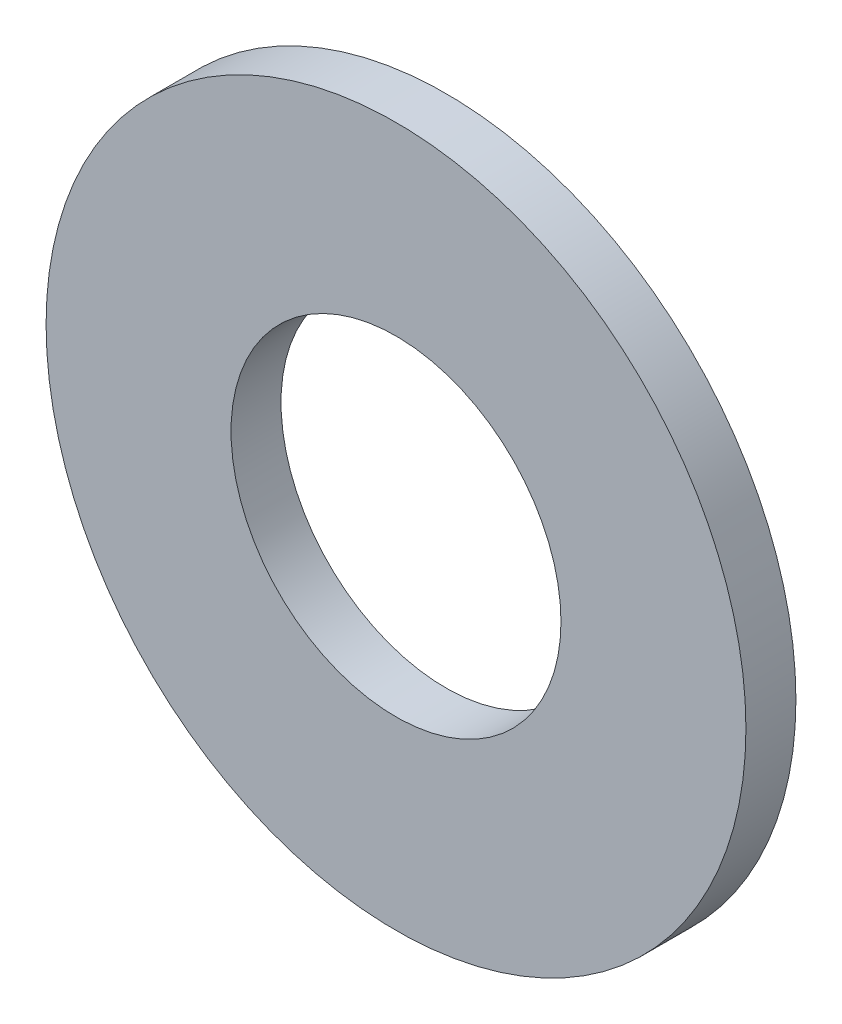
from build123d import *

# Parameters (mm, degrees)
ESQUISSE1_R      = 3.5
ESQUISSE1_R_2    = 1.65
EXTRUSION1_DEPTH = 0.5


with BuildPart() as part:
    # Esquisse1 → Extrusion1 (new body)
    with BuildSketch(Plane.XY):
        Circle(ESQUISSE1_R)
        Circle(ESQUISSE1_R_2, mode=Mode.SUBTRACT)
    extrude(amount=EXTRUSION1_DEPTH)


solid = part.part
